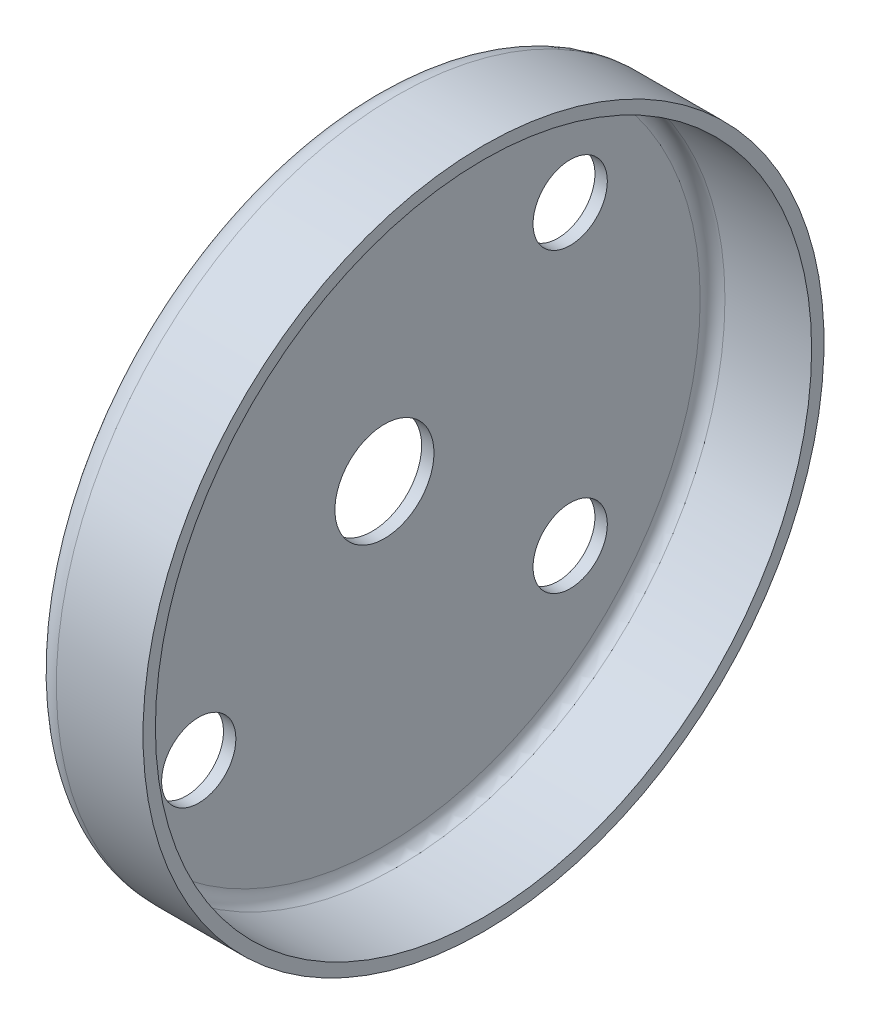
ISO-10303-21;
HEADER;
FILE_DESCRIPTION(('STEP AP214'),'2;1');
FILE_NAME('part.step','',(''),(''),'','','');
FILE_SCHEMA(('AUTOMOTIVE_DESIGN { 1 0 10303 214 1 1 1 1 }'));
ENDSEC;
DATA;
#1=APPLICATION_CONTEXT('core data for automotive mechanical design processes');
#2=APPLICATION_PROTOCOL_DEFINITION('international standard','automotive_design',2000,#1);
#3=PRODUCT_CONTEXT('',#1,'mechanical');
#4=PRODUCT('Part','Part','',(#3));
#5=PRODUCT_RELATED_PRODUCT_CATEGORY('part','',(#4));
#6=PRODUCT_DEFINITION_FORMATION('','',#4);
#7=PRODUCT_DEFINITION_CONTEXT('part definition',#1,'design');
#8=PRODUCT_DEFINITION('design','',#6,#7);
#9=PRODUCT_DEFINITION_SHAPE('','',#8);
#10=(LENGTH_UNIT() NAMED_UNIT(*) SI_UNIT(.MILLI.,.METRE.));
#11=(NAMED_UNIT(*) PLANE_ANGLE_UNIT() SI_UNIT($,.RADIAN.));
#12=(NAMED_UNIT(*) SI_UNIT($,.STERADIAN.) SOLID_ANGLE_UNIT());
#13=UNCERTAINTY_MEASURE_WITH_UNIT(LENGTH_MEASURE(1.E-05),#10,'distance_accuracy_value','');
#14=(GEOMETRIC_REPRESENTATION_CONTEXT(3) GLOBAL_UNCERTAINTY_ASSIGNED_CONTEXT((#13)) GLOBAL_UNIT_ASSIGNED_CONTEXT((#10,
#11,#12)) REPRESENTATION_CONTEXT('',''));
#15=CARTESIAN_POINT('',(0.,0.,0.));
#16=DIRECTION('',(0.,0.,1.));
#17=DIRECTION('',(1.,0.,0.));
#18=AXIS2_PLACEMENT_3D('',#15,#16,#17);
#19=CARTESIAN_POINT('',(25.,0.,0.));
#20=DIRECTION('',(-1.,0.,0.));
#21=DIRECTION('',(0.,0.,1.));
#22=AXIS2_PLACEMENT_3D('',#19,#20,#21);
#23=CYLINDRICAL_SURFACE('',#22,4.);
#24=CARTESIAN_POINT('',(0.,0.,0.));
#25=DIRECTION('',(1.,0.,0.));
#26=DIRECTION('',(0.,0.,-1.));
#27=AXIS2_PLACEMENT_3D('',#24,#25,#26);
#28=CIRCLE('',#27,4.);
#29=CARTESIAN_POINT('',(0.,0.,-4.));
#30=VERTEX_POINT('',#29);
#31=EDGE_CURVE('E40',#30,#30,#28,.T.);
#32=ORIENTED_EDGE('',*,*,#31,.F.);
#33=EDGE_LOOP('',(#32));
#34=FACE_BOUND('',#33,.T.);
#35=CARTESIAN_POINT('',(1.,0.,0.));
#36=DIRECTION('',(1.,0.,0.));
#37=DIRECTION('',(0.,0.,-1.));
#38=AXIS2_PLACEMENT_3D('',#35,#36,#37);
#39=CIRCLE('',#38,4.);
#40=CARTESIAN_POINT('',(1.,0.,-4.));
#41=VERTEX_POINT('',#40);
#42=EDGE_CURVE('E71',#41,#41,#39,.T.);
#43=ORIENTED_EDGE('',*,*,#42,.T.);
#44=EDGE_LOOP('',(#43));
#45=FACE_BOUND('',#44,.T.);
#46=ADVANCED_FACE('F29',(#34,#45),#23,.F.);
#47=CARTESIAN_POINT('',(25.,12.,15.));
#48=DIRECTION('',(-1.,0.,0.));
#49=DIRECTION('',(0.,0.,1.));
#50=AXIS2_PLACEMENT_3D('',#47,#48,#49);
#51=CYLINDRICAL_SURFACE('',#50,3.);
#52=CARTESIAN_POINT('',(0.,12.,15.));
#53=DIRECTION('',(1.,0.,0.));
#54=DIRECTION('',(0.,0.,-1.));
#55=AXIS2_PLACEMENT_3D('',#52,#53,#54);
#56=CIRCLE('',#55,3.);
#57=CARTESIAN_POINT('',(0.,12.,12.));
#58=VERTEX_POINT('',#57);
#59=EDGE_CURVE('E44',#58,#58,#56,.T.);
#60=ORIENTED_EDGE('',*,*,#59,.F.);
#61=EDGE_LOOP('',(#60));
#62=FACE_BOUND('',#61,.T.);
#63=CARTESIAN_POINT('',(1.,12.,15.));
#64=DIRECTION('',(1.,0.,0.));
#65=DIRECTION('',(0.,0.,-1.));
#66=AXIS2_PLACEMENT_3D('',#63,#64,#65);
#67=CIRCLE('',#66,3.);
#68=CARTESIAN_POINT('',(1.,12.,12.));
#69=VERTEX_POINT('',#68);
#70=EDGE_CURVE('E70',#69,#69,#67,.T.);
#71=ORIENTED_EDGE('',*,*,#70,.T.);
#72=EDGE_LOOP('',(#71));
#73=FACE_BOUND('',#72,.T.);
#74=ADVANCED_FACE('F114',(#62,#73),#51,.F.);
#75=CARTESIAN_POINT('',(25.,-12.,15.));
#76=DIRECTION('',(-1.,0.,0.));
#77=DIRECTION('',(0.,0.,1.));
#78=AXIS2_PLACEMENT_3D('',#75,#76,#77);
#79=CYLINDRICAL_SURFACE('',#78,3.);
#80=CARTESIAN_POINT('',(0.,-12.,15.));
#81=DIRECTION('',(1.,0.,0.));
#82=DIRECTION('',(0.,0.,1.));
#83=AXIS2_PLACEMENT_3D('',#80,#81,#82);
#84=CIRCLE('',#83,3.);
#85=CARTESIAN_POINT('',(0.,-12.,18.));
#86=VERTEX_POINT('',#85);
#87=EDGE_CURVE('E49',#86,#86,#84,.T.);
#88=ORIENTED_EDGE('',*,*,#87,.F.);
#89=EDGE_LOOP('',(#88));
#90=FACE_BOUND('',#89,.T.);
#91=CARTESIAN_POINT('',(1.,-12.,15.));
#92=DIRECTION('',(1.,0.,0.));
#93=DIRECTION('',(0.,0.,-1.));
#94=AXIS2_PLACEMENT_3D('',#91,#92,#93);
#95=CIRCLE('',#94,3.);
#96=CARTESIAN_POINT('',(1.,-12.,12.));
#97=VERTEX_POINT('',#96);
#98=EDGE_CURVE('E67',#97,#97,#95,.T.);
#99=ORIENTED_EDGE('',*,*,#98,.T.);
#100=EDGE_LOOP('',(#99));
#101=FACE_BOUND('',#100,.T.);
#102=ADVANCED_FACE('F120',(#90,#101),#79,.F.);
#103=CARTESIAN_POINT('',(25.,12.,-15.));
#104=DIRECTION('',(-1.,0.,0.));
#105=DIRECTION('',(0.,0.,1.));
#106=AXIS2_PLACEMENT_3D('',#103,#104,#105);
#107=CYLINDRICAL_SURFACE('',#106,3.);
#108=CARTESIAN_POINT('',(0.,12.,-15.));
#109=DIRECTION('',(1.,0.,0.));
#110=DIRECTION('',(0.,0.,1.));
#111=AXIS2_PLACEMENT_3D('',#108,#109,#110);
#112=CIRCLE('',#111,3.);
#113=CARTESIAN_POINT('',(0.,12.,-12.));
#114=VERTEX_POINT('',#113);
#115=EDGE_CURVE('E52',#114,#114,#112,.T.);
#116=ORIENTED_EDGE('',*,*,#115,.F.);
#117=EDGE_LOOP('',(#116));
#118=FACE_BOUND('',#117,.T.);
#119=CARTESIAN_POINT('',(1.,12.,-15.));
#120=DIRECTION('',(1.,0.,0.));
#121=DIRECTION('',(0.,0.,-1.));
#122=AXIS2_PLACEMENT_3D('',#119,#120,#121);
#123=CIRCLE('',#122,3.);
#124=CARTESIAN_POINT('',(1.,12.,-18.));
#125=VERTEX_POINT('',#124);
#126=EDGE_CURVE('E65',#125,#125,#123,.T.);
#127=ORIENTED_EDGE('',*,*,#126,.T.);
#128=EDGE_LOOP('',(#127));
#129=FACE_BOUND('',#128,.T.);
#130=ADVANCED_FACE('F110',(#118,#129),#107,.F.);
#131=CARTESIAN_POINT('',(25.,-12.,-15.));
#132=DIRECTION('',(-1.,0.,0.));
#133=DIRECTION('',(0.,0.,1.));
#134=AXIS2_PLACEMENT_3D('',#131,#132,#133);
#135=CYLINDRICAL_SURFACE('',#134,3.);
#136=CARTESIAN_POINT('',(0.,-12.,-15.));
#137=DIRECTION('',(1.,0.,0.));
#138=DIRECTION('',(0.,0.,-1.));
#139=AXIS2_PLACEMENT_3D('',#136,#137,#138);
#140=CIRCLE('',#139,3.);
#141=CARTESIAN_POINT('',(0.,-12.,-18.));
#142=VERTEX_POINT('',#141);
#143=EDGE_CURVE('E55',#142,#142,#140,.T.);
#144=ORIENTED_EDGE('',*,*,#143,.F.);
#145=EDGE_LOOP('',(#144));
#146=FACE_BOUND('',#145,.T.);
#147=CARTESIAN_POINT('',(1.,-12.,-15.));
#148=DIRECTION('',(1.,0.,0.));
#149=DIRECTION('',(0.,0.,-1.));
#150=AXIS2_PLACEMENT_3D('',#147,#148,#149);
#151=CIRCLE('',#150,3.);
#152=CARTESIAN_POINT('',(1.,-12.,-18.));
#153=VERTEX_POINT('',#152);
#154=EDGE_CURVE('E62',#153,#153,#151,.T.);
#155=ORIENTED_EDGE('',*,*,#154,.T.);
#156=EDGE_LOOP('',(#155));
#157=FACE_BOUND('',#156,.T.);
#158=ADVANCED_FACE('F104',(#146,#157),#135,.F.);
#159=CARTESIAN_POINT('',(25.,0.,0.));
#160=DIRECTION('',(-1.,0.,0.));
#161=DIRECTION('',(0.,0.,1.));
#162=AXIS2_PLACEMENT_3D('',#159,#160,#161);
#163=CYLINDRICAL_SURFACE('',#162,27.5);
#164=CARTESIAN_POINT('',(2.,0.,0.));
#165=DIRECTION('',(1.,0.,0.));
#166=DIRECTION('',(0.,0.,-1.));
#167=AXIS2_PLACEMENT_3D('',#164,#165,#166);
#168=CIRCLE('',#167,27.5);
#169=CARTESIAN_POINT('',(2.,0.,-27.5));
#170=VERTEX_POINT('',#169);
#171=EDGE_CURVE('E36',#170,#170,#168,.T.);
#172=ORIENTED_EDGE('',*,*,#171,.T.);
#173=EDGE_LOOP('',(#172));
#174=FACE_BOUND('',#173,.T.);
#175=CARTESIAN_POINT('',(9.00000000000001,0.,0.));
#176=DIRECTION('',(1.,0.,0.));
#177=DIRECTION('',(0.,1.,0.));
#178=AXIS2_PLACEMENT_3D('',#175,#176,#177);
#179=CIRCLE('',#178,27.5);
#180=CARTESIAN_POINT('',(9.,27.5,0.));
#181=VERTEX_POINT('',#180);
#182=EDGE_CURVE('E58',#181,#181,#179,.T.);
#183=ORIENTED_EDGE('',*,*,#182,.F.);
#184=EDGE_LOOP('',(#183));
#185=FACE_BOUND('',#184,.T.);
#186=ADVANCED_FACE('F102',(#174,#185),#163,.T.);
#187=CARTESIAN_POINT('',(0.,0.,0.));
#188=DIRECTION('',(1.,0.,0.));
#189=DIRECTION('',(0.,0.,-1.));
#190=AXIS2_PLACEMENT_3D('',#187,#188,#189);
#191=PLANE('',#190);
#192=CARTESIAN_POINT('',(0.,0.,0.));
#193=DIRECTION('',(1.,0.,0.));
#194=DIRECTION('',(0.,0.,-1.));
#195=AXIS2_PLACEMENT_3D('',#192,#193,#194);
#196=CIRCLE('',#195,25.5);
#197=CARTESIAN_POINT('',(0.,0.,-25.5));
#198=VERTEX_POINT('',#197);
#199=EDGE_CURVE('E10',#198,#198,#196,.F.);
#200=ORIENTED_EDGE('',*,*,#199,.T.);
#201=EDGE_LOOP('',(#200));
#202=FACE_BOUND('',#201,.T.);
#203=ORIENTED_EDGE('',*,*,#115,.T.);
#204=EDGE_LOOP('',(#203));
#205=FACE_BOUND('',#204,.T.);
#206=ORIENTED_EDGE('',*,*,#59,.T.);
#207=EDGE_LOOP('',(#206));
#208=FACE_BOUND('',#207,.T.);
#209=ORIENTED_EDGE('',*,*,#31,.T.);
#210=EDGE_LOOP('',(#209));
#211=FACE_BOUND('',#210,.T.);
#212=ORIENTED_EDGE('',*,*,#87,.T.);
#213=EDGE_LOOP('',(#212));
#214=FACE_BOUND('',#213,.T.);
#215=ORIENTED_EDGE('',*,*,#143,.T.);
#216=EDGE_LOOP('',(#215));
#217=FACE_BOUND('',#216,.T.);
#218=ADVANCED_FACE('F98',(#202,#205,#208,#211,#214,#217),#191,.F.);
#219=CARTESIAN_POINT('',(9.,27.5,136.500841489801));
#220=DIRECTION('',(1.,0.,0.));
#221=DIRECTION('',(0.,1.,0.));
#222=AXIS2_PLACEMENT_3D('',#219,#220,#221);
#223=PLANE('',#222);
#224=CARTESIAN_POINT('',(9.00000000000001,0.,0.));
#225=DIRECTION('',(1.,0.,0.));
#226=DIRECTION('',(0.,1.,0.));
#227=AXIS2_PLACEMENT_3D('',#224,#225,#226);
#228=CIRCLE('',#227,26.5);
#229=CARTESIAN_POINT('',(9.,26.5,0.));
#230=VERTEX_POINT('',#229);
#231=EDGE_CURVE('E66',#230,#230,#228,.T.);
#232=ORIENTED_EDGE('',*,*,#231,.F.);
#233=EDGE_LOOP('',(#232));
#234=FACE_BOUND('',#233,.T.);
#235=ORIENTED_EDGE('',*,*,#182,.T.);
#236=EDGE_LOOP('',(#235));
#237=FACE_BOUND('',#236,.T.);
#238=ADVANCED_FACE('F95',(#234,#237),#223,.T.);
#239=CARTESIAN_POINT('',(2.,0.,0.));
#240=DIRECTION('',(1.,0.,0.));
#241=DIRECTION('',(0.,0.,-1.));
#242=AXIS2_PLACEMENT_3D('',#239,#240,#241);
#243=TOROIDAL_SURFACE('',#242,25.5,2.);
#244=ORIENTED_EDGE('',*,*,#199,.F.);
#245=EDGE_LOOP('',(#244));
#246=FACE_BOUND('',#245,.T.);
#247=ORIENTED_EDGE('',*,*,#171,.F.);
#248=EDGE_LOOP('',(#247));
#249=FACE_BOUND('',#248,.T.);
#250=ADVANCED_FACE('F31',(#246,#249),#243,.T.);
#251=CARTESIAN_POINT('',(25.,0.,0.));
#252=DIRECTION('',(-1.,0.,0.));
#253=DIRECTION('',(0.,0.,1.));
#254=AXIS2_PLACEMENT_3D('',#251,#252,#253);
#255=CYLINDRICAL_SURFACE('',#254,26.5);
#256=CARTESIAN_POINT('',(2.,0.,0.));
#257=DIRECTION('',(-1.,0.,0.));
#258=DIRECTION('',(0.,0.,1.));
#259=AXIS2_PLACEMENT_3D('',#256,#257,#258);
#260=CIRCLE('',#259,26.5);
#261=CARTESIAN_POINT('',(2.,0.,26.5));
#262=VERTEX_POINT('',#261);
#263=EDGE_CURVE('E74',#262,#262,#260,.F.);
#264=ORIENTED_EDGE('',*,*,#263,.F.);
#265=EDGE_LOOP('',(#264));
#266=FACE_BOUND('',#265,.T.);
#267=ORIENTED_EDGE('',*,*,#231,.T.);
#268=EDGE_LOOP('',(#267));
#269=FACE_BOUND('',#268,.T.);
#270=ADVANCED_FACE('F88',(#266,#269),#255,.F.);
#271=CARTESIAN_POINT('',(1.,0.,0.));
#272=DIRECTION('',(1.,0.,0.));
#273=DIRECTION('',(0.,0.,-1.));
#274=AXIS2_PLACEMENT_3D('',#271,#272,#273);
#275=PLANE('',#274);
#276=CARTESIAN_POINT('',(1.,0.,0.));
#277=DIRECTION('',(1.,0.,0.));
#278=DIRECTION('',(0.,0.,-1.));
#279=AXIS2_PLACEMENT_3D('',#276,#277,#278);
#280=CIRCLE('',#279,25.5);
#281=CARTESIAN_POINT('',(1.,0.,-25.5));
#282=VERTEX_POINT('',#281);
#283=EDGE_CURVE('E61',#282,#282,#280,.F.);
#284=ORIENTED_EDGE('',*,*,#283,.F.);
#285=EDGE_LOOP('',(#284));
#286=FACE_BOUND('',#285,.T.);
#287=ORIENTED_EDGE('',*,*,#126,.F.);
#288=EDGE_LOOP('',(#287));
#289=FACE_BOUND('',#288,.T.);
#290=ORIENTED_EDGE('',*,*,#70,.F.);
#291=EDGE_LOOP('',(#290));
#292=FACE_BOUND('',#291,.T.);
#293=ORIENTED_EDGE('',*,*,#42,.F.);
#294=EDGE_LOOP('',(#293));
#295=FACE_BOUND('',#294,.T.);
#296=ORIENTED_EDGE('',*,*,#98,.F.);
#297=EDGE_LOOP('',(#296));
#298=FACE_BOUND('',#297,.T.);
#299=ORIENTED_EDGE('',*,*,#154,.F.);
#300=EDGE_LOOP('',(#299));
#301=FACE_BOUND('',#300,.T.);
#302=ADVANCED_FACE('F91',(#286,#289,#292,#295,#298,#301),#275,.T.);
#303=CARTESIAN_POINT('',(2.,0.,0.));
#304=DIRECTION('',(1.,0.,0.));
#305=DIRECTION('',(0.,0.,-1.));
#306=AXIS2_PLACEMENT_3D('',#303,#304,#305);
#307=TOROIDAL_SURFACE('',#306,25.5,1.);
#308=ORIENTED_EDGE('',*,*,#283,.T.);
#309=EDGE_LOOP('',(#308));
#310=FACE_BOUND('',#309,.T.);
#311=ORIENTED_EDGE('',*,*,#263,.T.);
#312=EDGE_LOOP('',(#311));
#313=FACE_BOUND('',#312,.T.);
#314=ADVANCED_FACE('F86',(#310,#313),#307,.F.);
#315=CLOSED_SHELL('',(#46,#74,#102,#130,#158,#186,#218,#238,#250,#270,#302,#314));
#316=MANIFOLD_SOLID_BREP('B2',#315);
#317=ADVANCED_BREP_SHAPE_REPRESENTATION('',(#18,#316),#14);
#318=SHAPE_DEFINITION_REPRESENTATION(#9,#317);
ENDSEC;
END-ISO-10303-21;
